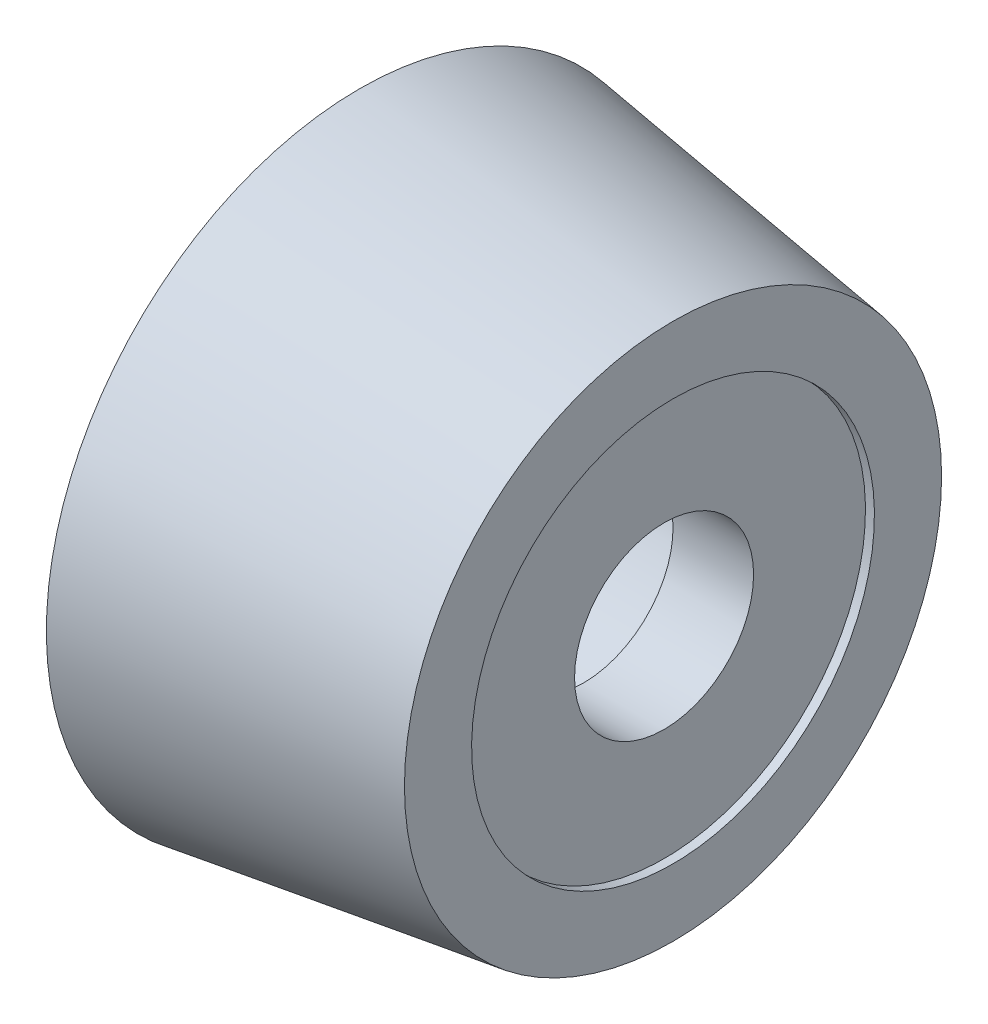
ISO-10303-21;
HEADER;
FILE_DESCRIPTION(('STEP AP214'),'2;1');
FILE_NAME('part.step','',(''),(''),'','','');
FILE_SCHEMA(('AUTOMOTIVE_DESIGN { 1 0 10303 214 1 1 1 1 }'));
ENDSEC;
DATA;
#1=APPLICATION_CONTEXT('core data for automotive mechanical design processes');
#2=APPLICATION_PROTOCOL_DEFINITION('international standard','automotive_design',2000,#1);
#3=PRODUCT_CONTEXT('',#1,'mechanical');
#4=PRODUCT('Part','Part','',(#3));
#5=PRODUCT_RELATED_PRODUCT_CATEGORY('part','',(#4));
#6=PRODUCT_DEFINITION_FORMATION('','',#4);
#7=PRODUCT_DEFINITION_CONTEXT('part definition',#1,'design');
#8=PRODUCT_DEFINITION('design','',#6,#7);
#9=PRODUCT_DEFINITION_SHAPE('','',#8);
#10=(LENGTH_UNIT() NAMED_UNIT(*) SI_UNIT(.MILLI.,.METRE.));
#11=(NAMED_UNIT(*) PLANE_ANGLE_UNIT() SI_UNIT($,.RADIAN.));
#12=(NAMED_UNIT(*) SI_UNIT($,.STERADIAN.) SOLID_ANGLE_UNIT());
#13=UNCERTAINTY_MEASURE_WITH_UNIT(LENGTH_MEASURE(1.E-05),#10,'distance_accuracy_value','');
#14=(GEOMETRIC_REPRESENTATION_CONTEXT(3) GLOBAL_UNCERTAINTY_ASSIGNED_CONTEXT((#13)) GLOBAL_UNIT_ASSIGNED_CONTEXT((#10,
#11,#12)) REPRESENTATION_CONTEXT('',''));
#15=CARTESIAN_POINT('',(0.,0.,0.));
#16=DIRECTION('',(0.,0.,1.));
#17=DIRECTION('',(1.,0.,0.));
#18=AXIS2_PLACEMENT_3D('',#15,#16,#17);
#19=CARTESIAN_POINT('',(-11.0928355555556,0.,0.));
#20=DIRECTION('',(-1.,0.,0.));
#21=DIRECTION('',(0.,-1.,0.));
#22=AXIS2_PLACEMENT_3D('',#19,#20,#21);
#23=CYLINDRICAL_SURFACE('',#22,2.);
#24=CARTESIAN_POINT('',(-13.0928355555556,0.,0.));
#25=DIRECTION('',(-1.,0.,0.));
#26=DIRECTION('',(0.,-1.,0.));
#27=AXIS2_PLACEMENT_3D('',#24,#25,#26);
#28=CIRCLE('',#27,2.);
#29=CARTESIAN_POINT('',(-13.0928355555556,-1.99999999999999,0.));
#30=VERTEX_POINT('',#29);
#31=EDGE_CURVE('E71',#30,#30,#28,.T.);
#32=ORIENTED_EDGE('',*,*,#31,.T.);
#33=EDGE_LOOP('',(#32));
#34=FACE_BOUND('',#33,.T.);
#35=CARTESIAN_POINT('',(-11.2928355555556,0.,0.));
#36=DIRECTION('',(1.,0.,0.));
#37=DIRECTION('',(0.,1.,0.));
#38=AXIS2_PLACEMENT_3D('',#35,#36,#37);
#39=CIRCLE('',#38,2.);
#40=CARTESIAN_POINT('',(-11.2928355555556,2.00000000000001,0.));
#41=VERTEX_POINT('',#40);
#42=EDGE_CURVE('E30',#41,#41,#39,.F.);
#43=ORIENTED_EDGE('',*,*,#42,.F.);
#44=EDGE_LOOP('',(#43));
#45=FACE_BOUND('',#44,.T.);
#46=ADVANCED_FACE('F26',(#34,#45),#23,.F.);
#47=CARTESIAN_POINT('',(-18.0928355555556,0.,0.));
#48=DIRECTION('',(-1.,0.,0.));
#49=DIRECTION('',(0.,-1.,0.));
#50=AXIS2_PLACEMENT_3D('',#47,#48,#49);
#51=PLANE('',#50);
#52=CARTESIAN_POINT('',(-18.0928355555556,0.,3.5));
#53=DIRECTION('',(-1.,0.,0.));
#54=DIRECTION('',(0.,-1.,0.));
#55=AXIS2_PLACEMENT_3D('',#52,#53,#54);
#56=CIRCLE('',#55,1.25028352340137);
#57=CARTESIAN_POINT('',(-18.0928355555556,-1.23017846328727,3.27668444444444));
#58=VERTEX_POINT('',#57);
#59=CARTESIAN_POINT('',(-18.0928355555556,1.23017846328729,3.27668444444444));
#60=VERTEX_POINT('',#59);
#61=EDGE_CURVE('E57',#58,#60,#56,.T.);
#62=ORIENTED_EDGE('',*,*,#61,.F.);
#63=CARTESIAN_POINT('',(-18.0928355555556,0.,0.));
#64=DIRECTION('',(-1.,0.,0.));
#65=DIRECTION('',(0.,-1.,0.));
#66=AXIS2_PLACEMENT_3D('',#63,#64,#65);
#67=CIRCLE('',#66,3.5);
#68=EDGE_CURVE('E64',#60,#58,#67,.T.);
#69=ORIENTED_EDGE('',*,*,#68,.F.);
#70=EDGE_LOOP('',(#62,#69));
#71=FACE_BOUND('',#70,.T.);
#72=CARTESIAN_POINT('',(-18.0928355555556,0.,0.));
#73=DIRECTION('',(1.,0.,0.));
#74=DIRECTION('',(0.,1.,0.));
#75=AXIS2_PLACEMENT_3D('',#72,#73,#74);
#76=CIRCLE('',#75,7.);
#77=CARTESIAN_POINT('',(-18.0928355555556,7.,0.));
#78=VERTEX_POINT('',#77);
#79=EDGE_CURVE('E11',#78,#78,#76,.T.);
#80=ORIENTED_EDGE('',*,*,#79,.F.);
#81=EDGE_LOOP('',(#80));
#82=FACE_BOUND('',#81,.T.);
#83=ADVANCED_FACE('F28',(#71,#82),#51,.T.);
#84=CARTESIAN_POINT('',(-11.0928355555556,0.,0.));
#85=DIRECTION('',(-1.,0.,0.));
#86=DIRECTION('',(0.,-1.,0.));
#87=AXIS2_PLACEMENT_3D('',#84,#85,#86);
#88=CONICAL_SURFACE('',#87,6.,0.141897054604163);
#89=ORIENTED_EDGE('',*,*,#79,.T.);
#90=EDGE_LOOP('',(#89));
#91=FACE_BOUND('',#90,.T.);
#92=CARTESIAN_POINT('',(-11.0928355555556,0.,0.));
#93=DIRECTION('',(1.,0.,0.));
#94=DIRECTION('',(0.,1.,0.));
#95=AXIS2_PLACEMENT_3D('',#92,#93,#94);
#96=CIRCLE('',#95,6.);
#97=CARTESIAN_POINT('',(-11.0928355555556,5.99999999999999,0.));
#98=VERTEX_POINT('',#97);
#99=EDGE_CURVE('E35',#98,#98,#96,.T.);
#100=ORIENTED_EDGE('',*,*,#99,.F.);
#101=EDGE_LOOP('',(#100));
#102=FACE_BOUND('',#101,.T.);
#103=ADVANCED_FACE('F86',(#91,#102),#88,.T.);
#104=CARTESIAN_POINT('',(-11.0928355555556,5.99999999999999,0.));
#105=DIRECTION('',(1.,0.,0.));
#106=DIRECTION('',(0.,1.,0.));
#107=AXIS2_PLACEMENT_3D('',#104,#105,#106);
#108=PLANE('',#107);
#109=CARTESIAN_POINT('',(-11.0928355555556,0.,0.));
#110=DIRECTION('',(1.,0.,0.));
#111=DIRECTION('',(0.,1.,0.));
#112=AXIS2_PLACEMENT_3D('',#109,#110,#111);
#113=CIRCLE('',#112,4.5);
#114=CARTESIAN_POINT('',(-11.0928355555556,4.50000000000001,0.));
#115=VERTEX_POINT('',#114);
#116=EDGE_CURVE('E79',#115,#115,#113,.T.);
#117=ORIENTED_EDGE('',*,*,#116,.F.);
#118=EDGE_LOOP('',(#117));
#119=FACE_BOUND('',#118,.T.);
#120=ORIENTED_EDGE('',*,*,#99,.T.);
#121=EDGE_LOOP('',(#120));
#122=FACE_BOUND('',#121,.T.);
#123=ADVANCED_FACE('F91',(#119,#122),#108,.T.);
#124=CARTESIAN_POINT('',(-13.0928355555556,0.,0.));
#125=DIRECTION('',(-1.,0.,0.));
#126=DIRECTION('',(0.,-1.,0.));
#127=AXIS2_PLACEMENT_3D('',#124,#125,#126);
#128=CYLINDRICAL_SURFACE('',#127,3.5);
#129=CARTESIAN_POINT('',(-13.0928355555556,0.,0.));
#130=DIRECTION('',(-1.,0.,0.));
#131=DIRECTION('',(0.,-1.,0.));
#132=AXIS2_PLACEMENT_3D('',#129,#130,#131);
#133=CIRCLE('',#132,3.5);
#134=CARTESIAN_POINT('',(-13.0928355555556,1.23017846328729,3.27668444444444));
#135=VERTEX_POINT('',#134);
#136=CARTESIAN_POINT('',(-13.0928355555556,-1.23017846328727,3.27668444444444));
#137=VERTEX_POINT('',#136);
#138=EDGE_CURVE('E62',#135,#137,#133,.T.);
#139=ORIENTED_EDGE('',*,*,#138,.F.);
#140=DIRECTION('',(-1.,0.,0.));
#141=VECTOR('',#140,1.);
#142=CARTESIAN_POINT('',(-15.5928355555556,1.23017846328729,3.27668444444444));
#143=LINE('',#142,#141);
#144=EDGE_CURVE('E55',#135,#60,#143,.T.);
#145=ORIENTED_EDGE('',*,*,#144,.T.);
#146=ORIENTED_EDGE('',*,*,#68,.T.);
#147=DIRECTION('',(-1.,0.,0.));
#148=VECTOR('',#147,1.);
#149=CARTESIAN_POINT('',(-15.5928355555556,-1.23017846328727,3.27668444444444));
#150=LINE('',#149,#148);
#151=EDGE_CURVE('E48',#58,#137,#150,.F.);
#152=ORIENTED_EDGE('',*,*,#151,.T.);
#153=EDGE_LOOP('',(#139,#145,#146,#152));
#154=FACE_BOUND('',#153,.T.);
#155=ADVANCED_FACE('F61',(#154),#128,.F.);
#156=CARTESIAN_POINT('',(-13.0928355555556,0.,0.));
#157=DIRECTION('',(-1.,0.,0.));
#158=DIRECTION('',(0.,-1.,0.));
#159=AXIS2_PLACEMENT_3D('',#156,#157,#158);
#160=PLANE('',#159);
#161=ORIENTED_EDGE('',*,*,#138,.T.);
#162=CARTESIAN_POINT('',(-13.0928355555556,0.,3.5));
#163=DIRECTION('',(-1.,0.,0.));
#164=DIRECTION('',(0.,-1.,0.));
#165=AXIS2_PLACEMENT_3D('',#162,#163,#164);
#166=CIRCLE('',#165,1.25028352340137);
#167=EDGE_CURVE('E41',#135,#137,#166,.F.);
#168=ORIENTED_EDGE('',*,*,#167,.F.);
#169=EDGE_LOOP('',(#161,#168));
#170=FACE_BOUND('',#169,.T.);
#171=ORIENTED_EDGE('',*,*,#31,.F.);
#172=EDGE_LOOP('',(#171));
#173=FACE_BOUND('',#172,.T.);
#174=ADVANCED_FACE('F66',(#170,#173),#160,.T.);
#175=CARTESIAN_POINT('',(-11.2928355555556,0.,0.));
#176=DIRECTION('',(1.,0.,0.));
#177=DIRECTION('',(0.,1.,0.));
#178=AXIS2_PLACEMENT_3D('',#175,#176,#177);
#179=PLANE('',#178);
#180=CARTESIAN_POINT('',(-11.2928355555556,0.,0.));
#181=DIRECTION('',(1.,0.,0.));
#182=DIRECTION('',(0.,1.,0.));
#183=AXIS2_PLACEMENT_3D('',#180,#181,#182);
#184=CIRCLE('',#183,4.5);
#185=CARTESIAN_POINT('',(-11.2928355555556,4.50000000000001,0.));
#186=VERTEX_POINT('',#185);
#187=EDGE_CURVE('E76',#186,#186,#184,.T.);
#188=ORIENTED_EDGE('',*,*,#187,.T.);
#189=EDGE_LOOP('',(#188));
#190=FACE_BOUND('',#189,.T.);
#191=ORIENTED_EDGE('',*,*,#42,.T.);
#192=EDGE_LOOP('',(#191));
#193=FACE_BOUND('',#192,.T.);
#194=ADVANCED_FACE('F114',(#190,#193),#179,.T.);
#195=CARTESIAN_POINT('',(-11.2928355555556,0.,0.));
#196=DIRECTION('',(1.,0.,0.));
#197=DIRECTION('',(0.,1.,0.));
#198=AXIS2_PLACEMENT_3D('',#195,#196,#197);
#199=CYLINDRICAL_SURFACE('',#198,4.5);
#200=ORIENTED_EDGE('',*,*,#187,.F.);
#201=EDGE_LOOP('',(#200));
#202=FACE_BOUND('',#201,.T.);
#203=ORIENTED_EDGE('',*,*,#116,.T.);
#204=EDGE_LOOP('',(#203));
#205=FACE_BOUND('',#204,.T.);
#206=ADVANCED_FACE('F111',(#202,#205),#199,.F.);
#207=CARTESIAN_POINT('',(-9.55649972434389,0.,3.5));
#208=DIRECTION('',(-1.,0.,0.));
#209=DIRECTION('',(0.,-1.,0.));
#210=AXIS2_PLACEMENT_3D('',#207,#208,#209);
#211=CYLINDRICAL_SURFACE('',#210,1.25028352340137);
#212=ORIENTED_EDGE('',*,*,#167,.T.);
#213=ORIENTED_EDGE('',*,*,#151,.F.);
#214=ORIENTED_EDGE('',*,*,#61,.T.);
#215=ORIENTED_EDGE('',*,*,#144,.F.);
#216=EDGE_LOOP('',(#212,#213,#214,#215));
#217=FACE_BOUND('',#216,.T.);
#218=ADVANCED_FACE('F53',(#217),#211,.F.);
#219=CLOSED_SHELL('',(#46,#83,#103,#123,#155,#174,#194,#206,#218));
#220=MANIFOLD_SOLID_BREP('B2',#219);
#221=ADVANCED_BREP_SHAPE_REPRESENTATION('',(#18,#220),#14);
#222=SHAPE_DEFINITION_REPRESENTATION(#9,#221);
ENDSEC;
END-ISO-10303-21;
